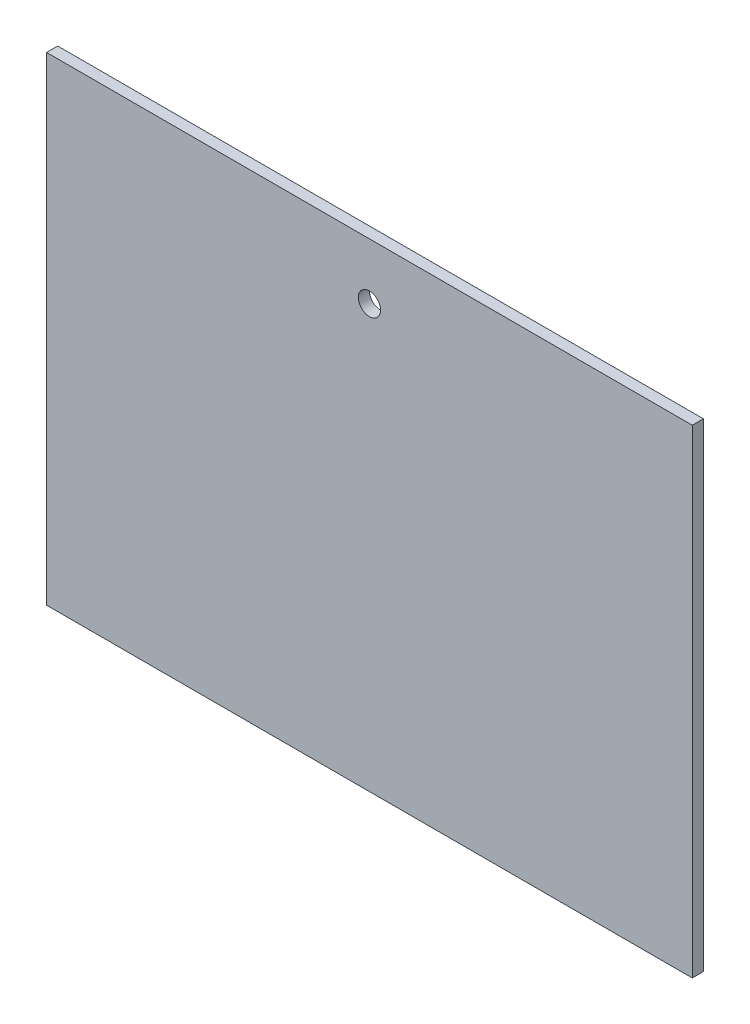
ISO-10303-21;
HEADER;
FILE_DESCRIPTION(('STEP AP214'),'2;1');
FILE_NAME('part.step','',(''),(''),'','','');
FILE_SCHEMA(('AUTOMOTIVE_DESIGN { 1 0 10303 214 1 1 1 1 }'));
ENDSEC;
DATA;
#1=APPLICATION_CONTEXT('core data for automotive mechanical design processes');
#2=APPLICATION_PROTOCOL_DEFINITION('international standard','automotive_design',2000,#1);
#3=PRODUCT_CONTEXT('',#1,'mechanical');
#4=PRODUCT('Part','Part','',(#3));
#5=PRODUCT_RELATED_PRODUCT_CATEGORY('part','',(#4));
#6=PRODUCT_DEFINITION_FORMATION('','',#4);
#7=PRODUCT_DEFINITION_CONTEXT('part definition',#1,'design');
#8=PRODUCT_DEFINITION('design','',#6,#7);
#9=PRODUCT_DEFINITION_SHAPE('','',#8);
#10=(LENGTH_UNIT() NAMED_UNIT(*) SI_UNIT(.MILLI.,.METRE.));
#11=(NAMED_UNIT(*) PLANE_ANGLE_UNIT() SI_UNIT($,.RADIAN.));
#12=(NAMED_UNIT(*) SI_UNIT($,.STERADIAN.) SOLID_ANGLE_UNIT());
#13=UNCERTAINTY_MEASURE_WITH_UNIT(LENGTH_MEASURE(1.E-05),#10,'distance_accuracy_value','');
#14=(GEOMETRIC_REPRESENTATION_CONTEXT(3) GLOBAL_UNCERTAINTY_ASSIGNED_CONTEXT((#13)) GLOBAL_UNIT_ASSIGNED_CONTEXT((#10,
#11,#12)) REPRESENTATION_CONTEXT('',''));
#15=CARTESIAN_POINT('',(0.,0.,0.));
#16=DIRECTION('',(0.,0.,1.));
#17=DIRECTION('',(1.,0.,0.));
#18=AXIS2_PLACEMENT_3D('',#15,#16,#17);
#19=CARTESIAN_POINT('',(510.716073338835,0.,10.));
#20=DIRECTION('',(-1.,0.,0.));
#21=DIRECTION('',(0.,0.,1.));
#22=AXIS2_PLACEMENT_3D('',#19,#20,#21);
#23=PLANE('',#22);
#24=DIRECTION('',(0.,1.,0.));
#25=VECTOR('',#24,1.);
#26=CARTESIAN_POINT('',(510.716073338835,0.,0.));
#27=LINE('',#26,#25);
#28=CARTESIAN_POINT('',(510.716073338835,-379.472880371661,0.));
#29=VERTEX_POINT('',#28);
#30=CARTESIAN_POINT('',(510.716073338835,50.5271196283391,0.));
#31=VERTEX_POINT('',#30);
#32=EDGE_CURVE('E100',#29,#31,#27,.T.);
#33=ORIENTED_EDGE('',*,*,#32,.T.);
#34=DIRECTION('',(0.,0.,-1.));
#35=VECTOR('',#34,1.);
#36=CARTESIAN_POINT('',(510.716073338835,50.5271196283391,10.));
#37=LINE('',#36,#35);
#38=CARTESIAN_POINT('',(510.716073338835,50.5271196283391,10.));
#39=VERTEX_POINT('',#38);
#40=EDGE_CURVE('E11',#39,#31,#37,.T.);
#41=ORIENTED_EDGE('',*,*,#40,.F.);
#42=DIRECTION('',(0.,1.,0.));
#43=VECTOR('',#42,1.);
#44=CARTESIAN_POINT('',(510.716073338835,0.,10.));
#45=LINE('',#44,#43);
#46=CARTESIAN_POINT('',(510.716073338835,-379.472880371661,10.));
#47=VERTEX_POINT('',#46);
#48=EDGE_CURVE('E85',#47,#39,#45,.T.);
#49=ORIENTED_EDGE('',*,*,#48,.F.);
#50=DIRECTION('',(0.,0.,-1.));
#51=VECTOR('',#50,1.);
#52=CARTESIAN_POINT('',(510.716073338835,-379.472880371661,10.));
#53=LINE('',#52,#51);
#54=EDGE_CURVE('E52',#47,#29,#53,.T.);
#55=ORIENTED_EDGE('',*,*,#54,.T.);
#56=EDGE_LOOP('',(#33,#41,#49,#55));
#57=FACE_BOUND('',#56,.T.);
#58=ADVANCED_FACE('F35',(#57),#23,.F.);
#59=CARTESIAN_POINT('',(0.,50.5271196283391,10.));
#60=DIRECTION('',(0.,-1.,0.));
#61=DIRECTION('',(0.,0.,-1.));
#62=AXIS2_PLACEMENT_3D('',#59,#60,#61);
#63=PLANE('',#62);
#64=DIRECTION('',(-1.,0.,0.));
#65=VECTOR('',#64,1.);
#66=CARTESIAN_POINT('',(0.,50.5271196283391,0.));
#67=LINE('',#66,#65);
#68=CARTESIAN_POINT('',(-69.2839266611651,50.5271196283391,0.));
#69=VERTEX_POINT('',#68);
#70=EDGE_CURVE('E90',#31,#69,#67,.T.);
#71=ORIENTED_EDGE('',*,*,#70,.T.);
#72=DIRECTION('',(0.,0.,-1.));
#73=VECTOR('',#72,1.);
#74=CARTESIAN_POINT('',(-69.2839266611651,50.5271196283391,10.));
#75=LINE('',#74,#73);
#76=CARTESIAN_POINT('',(-69.2839266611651,50.5271196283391,10.));
#77=VERTEX_POINT('',#76);
#78=EDGE_CURVE('E44',#77,#69,#75,.T.);
#79=ORIENTED_EDGE('',*,*,#78,.F.);
#80=DIRECTION('',(-1.,0.,0.));
#81=VECTOR('',#80,1.);
#82=CARTESIAN_POINT('',(0.,50.5271196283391,10.));
#83=LINE('',#82,#81);
#84=EDGE_CURVE('E78',#39,#77,#83,.T.);
#85=ORIENTED_EDGE('',*,*,#84,.F.);
#86=ORIENTED_EDGE('',*,*,#40,.T.);
#87=EDGE_LOOP('',(#71,#79,#85,#86));
#88=FACE_BOUND('',#87,.T.);
#89=ADVANCED_FACE('F89',(#88),#63,.F.);
#90=CARTESIAN_POINT('',(-69.2839266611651,0.,10.));
#91=DIRECTION('',(1.,0.,0.));
#92=DIRECTION('',(0.,1.,0.));
#93=AXIS2_PLACEMENT_3D('',#90,#91,#92);
#94=PLANE('',#93);
#95=DIRECTION('',(0.,-1.,0.));
#96=VECTOR('',#95,1.);
#97=CARTESIAN_POINT('',(-69.2839266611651,0.,0.));
#98=LINE('',#97,#96);
#99=CARTESIAN_POINT('',(-69.2839266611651,-379.472880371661,0.));
#100=VERTEX_POINT('',#99);
#101=EDGE_CURVE('E103',#69,#100,#98,.T.);
#102=ORIENTED_EDGE('',*,*,#101,.T.);
#103=DIRECTION('',(0.,0.,-1.));
#104=VECTOR('',#103,1.);
#105=CARTESIAN_POINT('',(-69.2839266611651,-379.472880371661,10.));
#106=LINE('',#105,#104);
#107=CARTESIAN_POINT('',(-69.2839266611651,-379.472880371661,10.));
#108=VERTEX_POINT('',#107);
#109=EDGE_CURVE('E67',#108,#100,#106,.T.);
#110=ORIENTED_EDGE('',*,*,#109,.F.);
#111=DIRECTION('',(0.,-1.,0.));
#112=VECTOR('',#111,1.);
#113=CARTESIAN_POINT('',(-69.2839266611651,0.,10.));
#114=LINE('',#113,#112);
#115=EDGE_CURVE('E84',#77,#108,#114,.T.);
#116=ORIENTED_EDGE('',*,*,#115,.F.);
#117=ORIENTED_EDGE('',*,*,#78,.T.);
#118=EDGE_LOOP('',(#102,#110,#116,#117));
#119=FACE_BOUND('',#118,.T.);
#120=ADVANCED_FACE('F94',(#119),#94,.F.);
#121=CARTESIAN_POINT('',(0.,-379.472880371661,10.));
#122=DIRECTION('',(0.,-1.,0.));
#123=DIRECTION('',(1.,0.,0.));
#124=AXIS2_PLACEMENT_3D('',#121,#122,#123);
#125=PLANE('',#124);
#126=DIRECTION('',(-1.,0.,0.));
#127=VECTOR('',#126,1.);
#128=CARTESIAN_POINT('',(0.,-379.472880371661,0.));
#129=LINE('',#128,#127);
#130=EDGE_CURVE('E105',#29,#100,#129,.T.);
#131=ORIENTED_EDGE('',*,*,#130,.F.);
#132=ORIENTED_EDGE('',*,*,#54,.F.);
#133=DIRECTION('',(-1.,0.,0.));
#134=VECTOR('',#133,1.);
#135=CARTESIAN_POINT('',(0.,-379.472880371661,10.));
#136=LINE('',#135,#134);
#137=EDGE_CURVE('E95',#47,#108,#136,.T.);
#138=ORIENTED_EDGE('',*,*,#137,.T.);
#139=ORIENTED_EDGE('',*,*,#109,.T.);
#140=EDGE_LOOP('',(#131,#132,#138,#139));
#141=FACE_BOUND('',#140,.T.);
#142=ADVANCED_FACE('F132',(#141),#125,.T.);
#143=CARTESIAN_POINT('',(0.,0.,10.));
#144=DIRECTION('',(0.,0.,1.));
#145=DIRECTION('',(1.,0.,0.));
#146=AXIS2_PLACEMENT_3D('',#143,#144,#145);
#147=PLANE('',#146);
#148=CARTESIAN_POINT('',(220.716073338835,0.,10.));
#149=DIRECTION('',(0.,0.,1.));
#150=DIRECTION('',(1.,0.,0.));
#151=AXIS2_PLACEMENT_3D('',#148,#149,#150);
#152=CIRCLE('',#151,9.99999999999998);
#153=CARTESIAN_POINT('',(230.716073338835,0.,10.));
#154=VERTEX_POINT('',#153);
#155=EDGE_CURVE('E111',#154,#154,#152,.T.);
#156=ORIENTED_EDGE('',*,*,#155,.F.);
#157=EDGE_LOOP('',(#156));
#158=FACE_BOUND('',#157,.T.);
#159=ORIENTED_EDGE('',*,*,#48,.T.);
#160=ORIENTED_EDGE('',*,*,#84,.T.);
#161=ORIENTED_EDGE('',*,*,#115,.T.);
#162=ORIENTED_EDGE('',*,*,#137,.F.);
#163=EDGE_LOOP('',(#159,#160,#161,#162));
#164=FACE_BOUND('',#163,.T.);
#165=ADVANCED_FACE('F81',(#158,#164),#147,.T.);
#166=CARTESIAN_POINT('',(0.,0.,0.));
#167=DIRECTION('',(0.,0.,1.));
#168=DIRECTION('',(1.,0.,0.));
#169=AXIS2_PLACEMENT_3D('',#166,#167,#168);
#170=PLANE('',#169);
#171=CARTESIAN_POINT('',(220.716073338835,0.,0.));
#172=DIRECTION('',(0.,0.,1.));
#173=DIRECTION('',(1.,0.,0.));
#174=AXIS2_PLACEMENT_3D('',#171,#172,#173);
#175=CIRCLE('',#174,9.99999999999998);
#176=CARTESIAN_POINT('',(230.716073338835,0.,0.));
#177=VERTEX_POINT('',#176);
#178=EDGE_CURVE('E38',#177,#177,#175,.T.);
#179=ORIENTED_EDGE('',*,*,#178,.T.);
#180=EDGE_LOOP('',(#179));
#181=FACE_BOUND('',#180,.T.);
#182=ORIENTED_EDGE('',*,*,#32,.F.);
#183=ORIENTED_EDGE('',*,*,#130,.T.);
#184=ORIENTED_EDGE('',*,*,#101,.F.);
#185=ORIENTED_EDGE('',*,*,#70,.F.);
#186=EDGE_LOOP('',(#182,#183,#184,#185));
#187=FACE_BOUND('',#186,.T.);
#188=ADVANCED_FACE('F118',(#181,#187),#170,.F.);
#189=CARTESIAN_POINT('',(220.716073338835,0.,-20.));
#190=DIRECTION('',(0.,0.,1.));
#191=DIRECTION('',(1.,0.,0.));
#192=AXIS2_PLACEMENT_3D('',#189,#190,#191);
#193=CYLINDRICAL_SURFACE('',#192,9.99999999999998);
#194=ORIENTED_EDGE('',*,*,#155,.T.);
#195=EDGE_LOOP('',(#194));
#196=FACE_BOUND('',#195,.T.);
#197=ORIENTED_EDGE('',*,*,#178,.F.);
#198=EDGE_LOOP('',(#197));
#199=FACE_BOUND('',#198,.T.);
#200=ADVANCED_FACE('F120',(#196,#199),#193,.F.);
#201=CLOSED_SHELL('',(#58,#89,#120,#142,#165,#188,#200));
#202=MANIFOLD_SOLID_BREP('B2',#201);
#203=ADVANCED_BREP_SHAPE_REPRESENTATION('',(#18,#202),#14);
#204=SHAPE_DEFINITION_REPRESENTATION(#9,#203);
ENDSEC;
END-ISO-10303-21;
